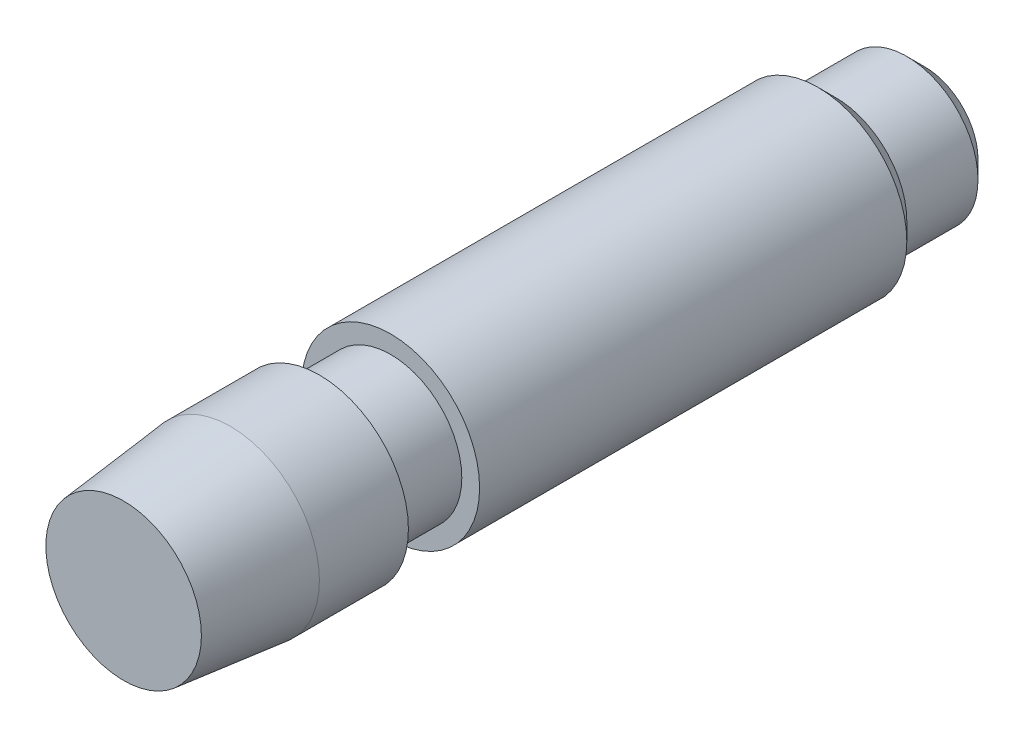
ISO-10303-21;
HEADER;
FILE_DESCRIPTION(('STEP AP214'),'2;1');
FILE_NAME('part.step','',(''),(''),'','','');
FILE_SCHEMA(('AUTOMOTIVE_DESIGN { 1 0 10303 214 1 1 1 1 }'));
ENDSEC;
DATA;
#1=APPLICATION_CONTEXT('core data for automotive mechanical design processes');
#2=APPLICATION_PROTOCOL_DEFINITION('international standard','automotive_design',2000,#1);
#3=PRODUCT_CONTEXT('',#1,'mechanical');
#4=PRODUCT('Part','Part','',(#3));
#5=PRODUCT_RELATED_PRODUCT_CATEGORY('part','',(#4));
#6=PRODUCT_DEFINITION_FORMATION('','',#4);
#7=PRODUCT_DEFINITION_CONTEXT('part definition',#1,'design');
#8=PRODUCT_DEFINITION('design','',#6,#7);
#9=PRODUCT_DEFINITION_SHAPE('','',#8);
#10=(LENGTH_UNIT() NAMED_UNIT(*) SI_UNIT(.MILLI.,.METRE.));
#11=(NAMED_UNIT(*) PLANE_ANGLE_UNIT() SI_UNIT($,.RADIAN.));
#12=(NAMED_UNIT(*) SI_UNIT($,.STERADIAN.) SOLID_ANGLE_UNIT());
#13=UNCERTAINTY_MEASURE_WITH_UNIT(LENGTH_MEASURE(1.E-05),#10,'distance_accuracy_value','');
#14=(GEOMETRIC_REPRESENTATION_CONTEXT(3) GLOBAL_UNCERTAINTY_ASSIGNED_CONTEXT((#13)) GLOBAL_UNIT_ASSIGNED_CONTEXT((#10,
#11,#12)) REPRESENTATION_CONTEXT('',''));
#15=CARTESIAN_POINT('',(0.,0.,0.));
#16=DIRECTION('',(0.,0.,1.));
#17=DIRECTION('',(1.,0.,0.));
#18=AXIS2_PLACEMENT_3D('',#15,#16,#17);
#19=CARTESIAN_POINT('',(0.,0.,30.));
#20=DIRECTION('',(0.,0.,1.));
#21=DIRECTION('',(1.,0.,0.));
#22=AXIS2_PLACEMENT_3D('',#19,#20,#21);
#23=PLANE('',#22);
#24=CARTESIAN_POINT('',(0.,0.,30.));
#25=DIRECTION('',(0.,0.,1.));
#26=DIRECTION('',(1.,0.,0.));
#27=AXIS2_PLACEMENT_3D('',#24,#25,#26);
#28=CIRCLE('',#27,5.);
#29=CARTESIAN_POINT('',(5.,0.,30.));
#30=VERTEX_POINT('',#29);
#31=EDGE_CURVE('E42',#30,#30,#28,.T.);
#32=ORIENTED_EDGE('',*,*,#31,.T.);
#33=EDGE_LOOP('',(#32));
#34=FACE_BOUND('',#33,.T.);
#35=CARTESIAN_POINT('',(0.,0.,30.));
#36=DIRECTION('',(0.,0.,1.));
#37=DIRECTION('',(1.,0.,0.));
#38=AXIS2_PLACEMENT_3D('',#35,#36,#37);
#39=CIRCLE('',#38,4.);
#40=CARTESIAN_POINT('',(4.,0.,30.));
#41=VERTEX_POINT('',#40);
#42=EDGE_CURVE('E48',#41,#41,#39,.T.);
#43=ORIENTED_EDGE('',*,*,#42,.F.);
#44=EDGE_LOOP('',(#43));
#45=FACE_BOUND('',#44,.T.);
#46=ADVANCED_FACE('F22',(#34,#45),#23,.T.);
#47=CARTESIAN_POINT('',(0.,0.,5.));
#48=DIRECTION('',(0.,0.,-1.));
#49=DIRECTION('',(-1.,0.,0.));
#50=AXIS2_PLACEMENT_3D('',#47,#48,#49);
#51=CYLINDRICAL_SURFACE('',#50,4.);
#52=CARTESIAN_POINT('',(0.,0.,1.));
#53=DIRECTION('',(0.,0.,1.));
#54=DIRECTION('',(1.,0.,0.));
#55=AXIS2_PLACEMENT_3D('',#52,#53,#54);
#56=CIRCLE('',#55,4.);
#57=CARTESIAN_POINT('',(4.,0.,1.));
#58=VERTEX_POINT('',#57);
#59=EDGE_CURVE('E33',#58,#58,#56,.T.);
#60=ORIENTED_EDGE('',*,*,#59,.T.);
#61=EDGE_LOOP('',(#60));
#62=FACE_BOUND('',#61,.T.);
#63=CARTESIAN_POINT('',(0.,0.,5.));
#64=DIRECTION('',(0.,0.,1.));
#65=DIRECTION('',(1.,0.,0.));
#66=AXIS2_PLACEMENT_3D('',#63,#64,#65);
#67=CIRCLE('',#66,4.);
#68=CARTESIAN_POINT('',(4.,0.,5.));
#69=VERTEX_POINT('',#68);
#70=EDGE_CURVE('E37',#69,#69,#67,.T.);
#71=ORIENTED_EDGE('',*,*,#70,.F.);
#72=EDGE_LOOP('',(#71));
#73=FACE_BOUND('',#72,.T.);
#74=ADVANCED_FACE('F24',(#62,#73),#51,.T.);
#75=CARTESIAN_POINT('',(0.,0.,0.));
#76=DIRECTION('',(0.,0.,1.));
#77=DIRECTION('',(1.,0.,0.));
#78=AXIS2_PLACEMENT_3D('',#75,#76,#77);
#79=PLANE('',#78);
#80=CARTESIAN_POINT('',(0.,0.,0.));
#81=DIRECTION('',(0.,0.,1.));
#82=DIRECTION('',(1.,0.,0.));
#83=AXIS2_PLACEMENT_3D('',#80,#81,#82);
#84=CIRCLE('',#83,3.);
#85=CARTESIAN_POINT('',(3.,0.,0.));
#86=VERTEX_POINT('',#85);
#87=EDGE_CURVE('E29',#86,#86,#84,.F.);
#88=ORIENTED_EDGE('',*,*,#87,.T.);
#89=EDGE_LOOP('',(#88));
#90=FACE_BOUND('',#89,.T.);
#91=ADVANCED_FACE('F94',(#90),#79,.F.);
#92=CARTESIAN_POINT('',(0.,0.,30.));
#93=DIRECTION('',(0.,0.,-1.));
#94=DIRECTION('',(-1.,0.,0.));
#95=AXIS2_PLACEMENT_3D('',#92,#93,#94);
#96=CYLINDRICAL_SURFACE('',#95,5.);
#97=CARTESIAN_POINT('',(0.,0.,6.));
#98=DIRECTION('',(0.,0.,1.));
#99=DIRECTION('',(1.,0.,0.));
#100=AXIS2_PLACEMENT_3D('',#97,#98,#99);
#101=CIRCLE('',#100,5.);
#102=CARTESIAN_POINT('',(5.,0.,6.));
#103=VERTEX_POINT('',#102);
#104=EDGE_CURVE('E10',#103,#103,#101,.T.);
#105=ORIENTED_EDGE('',*,*,#104,.T.);
#106=EDGE_LOOP('',(#105));
#107=FACE_BOUND('',#106,.T.);
#108=ORIENTED_EDGE('',*,*,#31,.F.);
#109=EDGE_LOOP('',(#108));
#110=FACE_BOUND('',#109,.T.);
#111=ADVANCED_FACE('F100',(#107,#110),#96,.T.);
#112=CARTESIAN_POINT('',(0.,0.,1.));
#113=DIRECTION('',(0.,0.,1.));
#114=DIRECTION('',(1.,0.,0.));
#115=AXIS2_PLACEMENT_3D('',#112,#113,#114);
#116=CONICAL_SURFACE('',#115,4.,0.78539816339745);
#117=ORIENTED_EDGE('',*,*,#87,.F.);
#118=EDGE_LOOP('',(#117));
#119=FACE_BOUND('',#118,.T.);
#120=ORIENTED_EDGE('',*,*,#59,.F.);
#121=EDGE_LOOP('',(#120));
#122=FACE_BOUND('',#121,.T.);
#123=ADVANCED_FACE('F98',(#119,#122),#116,.T.);
#124=CARTESIAN_POINT('',(0.,0.,6.));
#125=DIRECTION('',(0.,0.,1.));
#126=DIRECTION('',(1.,0.,0.));
#127=AXIS2_PLACEMENT_3D('',#124,#125,#126);
#128=CONICAL_SURFACE('',#127,5.,0.78539816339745);
#129=ORIENTED_EDGE('',*,*,#70,.T.);
#130=EDGE_LOOP('',(#129));
#131=FACE_BOUND('',#130,.T.);
#132=ORIENTED_EDGE('',*,*,#104,.F.);
#133=EDGE_LOOP('',(#132));
#134=FACE_BOUND('',#133,.T.);
#135=ADVANCED_FACE('F84',(#131,#134),#128,.T.);
#136=CARTESIAN_POINT('',(0.,0.,34.));
#137=DIRECTION('',(0.,0.,-1.));
#138=DIRECTION('',(-1.,0.,0.));
#139=AXIS2_PLACEMENT_3D('',#136,#137,#138);
#140=CYLINDRICAL_SURFACE('',#139,4.);
#141=CARTESIAN_POINT('',(0.,0.,34.));
#142=DIRECTION('',(0.,0.,1.));
#143=DIRECTION('',(1.,0.,0.));
#144=AXIS2_PLACEMENT_3D('',#141,#142,#143);
#145=CIRCLE('',#144,4.);
#146=CARTESIAN_POINT('',(4.,0.,34.));
#147=VERTEX_POINT('',#146);
#148=EDGE_CURVE('E45',#147,#147,#145,.T.);
#149=ORIENTED_EDGE('',*,*,#148,.F.);
#150=EDGE_LOOP('',(#149));
#151=FACE_BOUND('',#150,.T.);
#152=ORIENTED_EDGE('',*,*,#42,.T.);
#153=EDGE_LOOP('',(#152));
#154=FACE_BOUND('',#153,.T.);
#155=ADVANCED_FACE('F78',(#151,#154),#140,.T.);
#156=CARTESIAN_POINT('',(0.,0.,34.));
#157=DIRECTION('',(0.,0.,1.));
#158=DIRECTION('',(1.,0.,0.));
#159=AXIS2_PLACEMENT_3D('',#156,#157,#158);
#160=PLANE('',#159);
#161=CARTESIAN_POINT('',(0.,0.,34.));
#162=DIRECTION('',(0.,0.,1.));
#163=DIRECTION('',(1.,0.,0.));
#164=AXIS2_PLACEMENT_3D('',#161,#162,#163);
#165=CIRCLE('',#164,5.);
#166=CARTESIAN_POINT('',(5.,0.,34.));
#167=VERTEX_POINT('',#166);
#168=EDGE_CURVE('E54',#167,#167,#165,.T.);
#169=ORIENTED_EDGE('',*,*,#168,.F.);
#170=EDGE_LOOP('',(#169));
#171=FACE_BOUND('',#170,.T.);
#172=ORIENTED_EDGE('',*,*,#148,.T.);
#173=EDGE_LOOP('',(#172));
#174=FACE_BOUND('',#173,.T.);
#175=ADVANCED_FACE('F72',(#171,#174),#160,.F.);
#176=CARTESIAN_POINT('',(0.,0.,39.));
#177=DIRECTION('',(0.,0.,-1.));
#178=DIRECTION('',(-1.,0.,0.));
#179=AXIS2_PLACEMENT_3D('',#176,#177,#178);
#180=CYLINDRICAL_SURFACE('',#179,5.);
#181=CARTESIAN_POINT('',(0.,0.,39.));
#182=DIRECTION('',(0.,0.,1.));
#183=DIRECTION('',(1.,0.,0.));
#184=AXIS2_PLACEMENT_3D('',#181,#182,#183);
#185=CIRCLE('',#184,5.);
#186=CARTESIAN_POINT('',(5.,0.,39.));
#187=VERTEX_POINT('',#186);
#188=EDGE_CURVE('E51',#187,#187,#185,.T.);
#189=ORIENTED_EDGE('',*,*,#188,.F.);
#190=EDGE_LOOP('',(#189));
#191=FACE_BOUND('',#190,.T.);
#192=ORIENTED_EDGE('',*,*,#168,.T.);
#193=EDGE_LOOP('',(#192));
#194=FACE_BOUND('',#193,.T.);
#195=ADVANCED_FACE('F66',(#191,#194),#180,.T.);
#196=CARTESIAN_POINT('',(0.,0.,39.));
#197=DIRECTION('',(0.,0.,-1.));
#198=DIRECTION('',(1.,0.,0.));
#199=AXIS2_PLACEMENT_3D('',#196,#197,#198);
#200=CONICAL_SURFACE('',#199,5.,0.10471975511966);
#201=CARTESIAN_POINT('',(0.,0.,45.));
#202=DIRECTION('',(0.,0.,1.));
#203=DIRECTION('',(1.,0.,0.));
#204=AXIS2_PLACEMENT_3D('',#201,#202,#203);
#205=CIRCLE('',#204,4.36937458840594);
#206=CARTESIAN_POINT('',(4.36937458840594,0.,45.));
#207=VERTEX_POINT('',#206);
#208=EDGE_CURVE('E57',#207,#207,#205,.T.);
#209=ORIENTED_EDGE('',*,*,#208,.F.);
#210=EDGE_LOOP('',(#209));
#211=FACE_BOUND('',#210,.T.);
#212=ORIENTED_EDGE('',*,*,#188,.T.);
#213=EDGE_LOOP('',(#212));
#214=FACE_BOUND('',#213,.T.);
#215=ADVANCED_FACE('F63',(#211,#214),#200,.T.);
#216=CARTESIAN_POINT('',(0.,0.,45.));
#217=DIRECTION('',(0.,0.,1.));
#218=DIRECTION('',(1.,0.,0.));
#219=AXIS2_PLACEMENT_3D('',#216,#217,#218);
#220=PLANE('',#219);
#221=ORIENTED_EDGE('',*,*,#208,.T.);
#222=EDGE_LOOP('',(#221));
#223=FACE_BOUND('',#222,.T.);
#224=ADVANCED_FACE('F61',(#223),#220,.T.);
#225=CLOSED_SHELL('',(#46,#74,#91,#111,#123,#135,#155,#175,#195,#215,#224));
#226=MANIFOLD_SOLID_BREP('B2',#225);
#227=ADVANCED_BREP_SHAPE_REPRESENTATION('',(#18,#226),#14);
#228=SHAPE_DEFINITION_REPRESENTATION(#9,#227);
ENDSEC;
END-ISO-10303-21;
